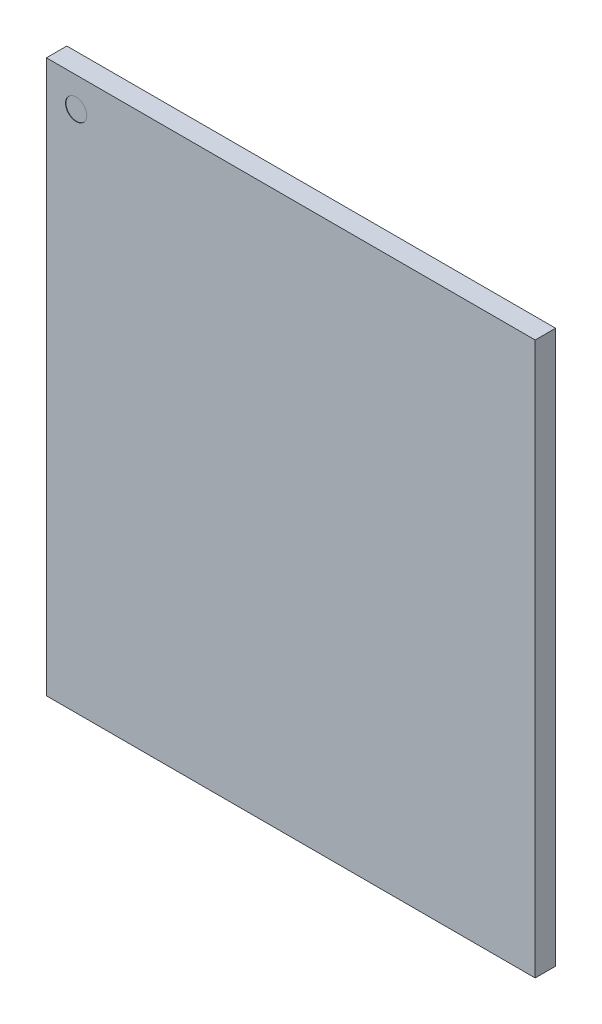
ISO-10303-21;
HEADER;
FILE_DESCRIPTION(('STEP AP214'),'2;1');
FILE_NAME('part.step','',(''),(''),'','','');
FILE_SCHEMA(('AUTOMOTIVE_DESIGN { 1 0 10303 214 1 1 1 1 }'));
ENDSEC;
DATA;
#1=APPLICATION_CONTEXT('core data for automotive mechanical design processes');
#2=APPLICATION_PROTOCOL_DEFINITION('international standard','automotive_design',2000,#1);
#3=PRODUCT_CONTEXT('',#1,'mechanical');
#4=PRODUCT('Part','Part','',(#3));
#5=PRODUCT_RELATED_PRODUCT_CATEGORY('part','',(#4));
#6=PRODUCT_DEFINITION_FORMATION('','',#4);
#7=PRODUCT_DEFINITION_CONTEXT('part definition',#1,'design');
#8=PRODUCT_DEFINITION('design','',#6,#7);
#9=PRODUCT_DEFINITION_SHAPE('','',#8);
#10=(LENGTH_UNIT() NAMED_UNIT(*) SI_UNIT(.MILLI.,.METRE.));
#11=(NAMED_UNIT(*) PLANE_ANGLE_UNIT() SI_UNIT($,.RADIAN.));
#12=(NAMED_UNIT(*) SI_UNIT($,.STERADIAN.) SOLID_ANGLE_UNIT());
#13=UNCERTAINTY_MEASURE_WITH_UNIT(LENGTH_MEASURE(1.E-05),#10,'distance_accuracy_value','');
#14=(GEOMETRIC_REPRESENTATION_CONTEXT(3) GLOBAL_UNCERTAINTY_ASSIGNED_CONTEXT((#13)) GLOBAL_UNIT_ASSIGNED_CONTEXT((#10,
#11,#12)) REPRESENTATION_CONTEXT('',''));
#15=CARTESIAN_POINT('',(0.,0.,0.));
#16=DIRECTION('',(0.,0.,1.));
#17=DIRECTION('',(1.,0.,0.));
#18=AXIS2_PLACEMENT_3D('',#15,#16,#17);
#19=CARTESIAN_POINT('',(0.,-6.4999999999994,0.635));
#20=DIRECTION('',(0.,0.,1.));
#21=DIRECTION('',(1.,0.,0.));
#22=AXIS2_PLACEMENT_3D('',#19,#20,#21);
#23=PLANE('',#22);
#24=CARTESIAN_POINT('',(-5.05000000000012,5.79999999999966,0.635));
#25=DIRECTION('',(0.,0.,1.));
#26=DIRECTION('',(1.,0.,0.));
#27=AXIS2_PLACEMENT_3D('',#24,#25,#26);
#28=CIRCLE('',#27,0.249999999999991);
#29=CARTESIAN_POINT('',(-4.80000000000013,5.79999999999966,0.635));
#30=VERTEX_POINT('',#29);
#31=EDGE_CURVE('E19',#30,#30,#28,.T.);
#32=ORIENTED_EDGE('',*,*,#31,.T.);
#33=EDGE_LOOP('',(#32));
#34=FACE_BOUND('',#33,.T.);
#35=ADVANCED_FACE('F16',(#34),#23,.T.);
#36=CARTESIAN_POINT('',(-5.05000000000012,5.79999999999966,0.64499999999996));
#37=DIRECTION('',(0.,0.,1.));
#38=DIRECTION('',(1.,0.,0.));
#39=AXIS2_PLACEMENT_3D('',#36,#37,#38);
#40=CYLINDRICAL_SURFACE('',#39,0.249999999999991);
#41=ORIENTED_EDGE('',*,*,#31,.F.);
#42=EDGE_LOOP('',(#41));
#43=FACE_BOUND('',#42,.T.);
#44=CARTESIAN_POINT('',(-5.05000000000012,5.79999999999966,0.64499999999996));
#45=DIRECTION('',(0.,0.,1.));
#46=DIRECTION('',(1.,0.,0.));
#47=AXIS2_PLACEMENT_3D('',#44,#45,#46);
#48=CIRCLE('',#47,0.249999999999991);
#49=CARTESIAN_POINT('',(-4.80000000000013,5.79999999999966,0.64499999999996));
#50=VERTEX_POINT('',#49);
#51=EDGE_CURVE('E68',#50,#50,#48,.F.);
#52=ORIENTED_EDGE('',*,*,#51,.F.);
#53=EDGE_LOOP('',(#52));
#54=FACE_BOUND('',#53,.T.);
#55=ADVANCED_FACE('F88',(#43,#54),#40,.F.);
#56=CARTESIAN_POINT('',(-5.74999999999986,-6.4999999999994,0.64499999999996));
#57=DIRECTION('',(0.,0.,1.));
#58=DIRECTION('',(1.,0.,0.));
#59=AXIS2_PLACEMENT_3D('',#56,#57,#58);
#60=PLANE('',#59);
#61=ORIENTED_EDGE('',*,*,#51,.T.);
#62=EDGE_LOOP('',(#61));
#63=FACE_BOUND('',#62,.T.);
#64=DIRECTION('',(0.,1.,0.));
#65=VECTOR('',#64,1.);
#66=CARTESIAN_POINT('',(-5.74999999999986,-6.4999999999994,0.64499999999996));
#67=LINE('',#66,#65);
#68=CARTESIAN_POINT('',(-5.74999999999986,-6.4999999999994,0.64499999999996));
#69=VERTEX_POINT('',#68);
#70=CARTESIAN_POINT('',(-5.74999999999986,6.4999999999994,0.64499999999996));
#71=VERTEX_POINT('',#70);
#72=EDGE_CURVE('E59',#69,#71,#67,.T.);
#73=ORIENTED_EDGE('',*,*,#72,.F.);
#74=DIRECTION('',(1.,0.,0.));
#75=VECTOR('',#74,1.);
#76=CARTESIAN_POINT('',(0.,-6.4999999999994,0.64499999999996));
#77=LINE('',#76,#75);
#78=CARTESIAN_POINT('',(5.74999999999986,-6.4999999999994,0.64499999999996));
#79=VERTEX_POINT('',#78);
#80=EDGE_CURVE('E199',#69,#79,#77,.T.);
#81=ORIENTED_EDGE('',*,*,#80,.T.);
#82=DIRECTION('',(0.,1.,0.));
#83=VECTOR('',#82,1.);
#84=CARTESIAN_POINT('',(5.74999999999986,-6.4999999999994,0.64499999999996));
#85=LINE('',#84,#83);
#86=CARTESIAN_POINT('',(5.74999999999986,6.4999999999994,0.64499999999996));
#87=VERTEX_POINT('',#86);
#88=EDGE_CURVE('E71',#87,#79,#85,.F.);
#89=ORIENTED_EDGE('',*,*,#88,.F.);
#90=DIRECTION('',(1.,0.,0.));
#91=VECTOR('',#90,1.);
#92=CARTESIAN_POINT('',(0.,6.4999999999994,0.64499999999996));
#93=LINE('',#92,#91);
#94=EDGE_CURVE('E54',#71,#87,#93,.T.);
#95=ORIENTED_EDGE('',*,*,#94,.F.);
#96=EDGE_LOOP('',(#73,#81,#89,#95));
#97=FACE_BOUND('',#96,.T.);
#98=ADVANCED_FACE('F70',(#63,#97),#60,.T.);
#99=CARTESIAN_POINT('',(-5.74999999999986,-6.4999999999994,0.165));
#100=DIRECTION('',(-1.,0.,0.));
#101=DIRECTION('',(0.,0.,1.));
#102=AXIS2_PLACEMENT_3D('',#99,#100,#101);
#103=PLANE('',#102);
#104=DIRECTION('',(0.,1.,0.));
#105=VECTOR('',#104,1.);
#106=CARTESIAN_POINT('',(-5.74999999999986,-6.4999999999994,0.165));
#107=LINE('',#106,#105);
#108=CARTESIAN_POINT('',(-5.74999999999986,-6.4999999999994,0.165));
#109=VERTEX_POINT('',#108);
#110=CARTESIAN_POINT('',(-5.74999999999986,6.4999999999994,0.165));
#111=VERTEX_POINT('',#110);
#112=EDGE_CURVE('E200',#109,#111,#107,.T.);
#113=ORIENTED_EDGE('',*,*,#112,.F.);
#114=DIRECTION('',(0.,0.,1.));
#115=VECTOR('',#114,1.);
#116=CARTESIAN_POINT('',(-5.74999999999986,-6.4999999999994,0.));
#117=LINE('',#116,#115);
#118=EDGE_CURVE('E64',#109,#69,#117,.T.);
#119=ORIENTED_EDGE('',*,*,#118,.T.);
#120=ORIENTED_EDGE('',*,*,#72,.T.);
#121=DIRECTION('',(0.,0.,1.));
#122=VECTOR('',#121,1.);
#123=CARTESIAN_POINT('',(-5.74999999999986,6.4999999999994,0.));
#124=LINE('',#123,#122);
#125=EDGE_CURVE('E61',#111,#71,#124,.T.);
#126=ORIENTED_EDGE('',*,*,#125,.F.);
#127=EDGE_LOOP('',(#113,#119,#120,#126));
#128=FACE_BOUND('',#127,.T.);
#129=ADVANCED_FACE('F60',(#128),#103,.T.);
#130=CARTESIAN_POINT('',(0.,6.4999999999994,0.));
#131=DIRECTION('',(0.,1.,0.));
#132=DIRECTION('',(0.,0.,1.));
#133=AXIS2_PLACEMENT_3D('',#130,#131,#132);
#134=PLANE('',#133);
#135=ORIENTED_EDGE('',*,*,#94,.T.);
#136=DIRECTION('',(0.,0.,-1.));
#137=VECTOR('',#136,1.);
#138=CARTESIAN_POINT('',(5.74999999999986,6.4999999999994,0.64499999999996));
#139=LINE('',#138,#137);
#140=CARTESIAN_POINT('',(5.74999999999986,6.4999999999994,0.165));
#141=VERTEX_POINT('',#140);
#142=EDGE_CURVE('E73',#141,#87,#139,.F.);
#143=ORIENTED_EDGE('',*,*,#142,.F.);
#144=DIRECTION('',(-1.,0.,0.));
#145=VECTOR('',#144,1.);
#146=CARTESIAN_POINT('',(5.74999999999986,6.4999999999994,0.165));
#147=LINE('',#146,#145);
#148=EDGE_CURVE('E77',#111,#141,#147,.F.);
#149=ORIENTED_EDGE('',*,*,#148,.F.);
#150=ORIENTED_EDGE('',*,*,#125,.T.);
#151=EDGE_LOOP('',(#135,#143,#149,#150));
#152=FACE_BOUND('',#151,.T.);
#153=ADVANCED_FACE('F75',(#152),#134,.T.);
#154=CARTESIAN_POINT('',(5.74999999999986,-6.4999999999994,0.64499999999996));
#155=DIRECTION('',(1.,0.,0.));
#156=DIRECTION('',(0.,0.,-1.));
#157=AXIS2_PLACEMENT_3D('',#154,#155,#156);
#158=PLANE('',#157);
#159=ORIENTED_EDGE('',*,*,#88,.T.);
#160=DIRECTION('',(0.,0.,1.));
#161=VECTOR('',#160,1.);
#162=CARTESIAN_POINT('',(5.74999999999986,-6.4999999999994,0.));
#163=LINE('',#162,#161);
#164=CARTESIAN_POINT('',(5.74999999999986,-6.4999999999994,0.165));
#165=VERTEX_POINT('',#164);
#166=EDGE_CURVE('E34',#79,#165,#163,.F.);
#167=ORIENTED_EDGE('',*,*,#166,.T.);
#168=DIRECTION('',(0.,1.,0.));
#169=VECTOR('',#168,1.);
#170=CARTESIAN_POINT('',(5.74999999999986,-6.4999999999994,0.165));
#171=LINE('',#170,#169);
#172=EDGE_CURVE('E25',#141,#165,#171,.F.);
#173=ORIENTED_EDGE('',*,*,#172,.F.);
#174=ORIENTED_EDGE('',*,*,#142,.T.);
#175=EDGE_LOOP('',(#159,#167,#173,#174));
#176=FACE_BOUND('',#175,.T.);
#177=ADVANCED_FACE('F105',(#176),#158,.T.);
#178=CARTESIAN_POINT('',(0.,-6.4999999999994,0.));
#179=DIRECTION('',(0.,1.,0.));
#180=DIRECTION('',(0.,0.,1.));
#181=AXIS2_PLACEMENT_3D('',#178,#179,#180);
#182=PLANE('',#181);
#183=ORIENTED_EDGE('',*,*,#118,.F.);
#184=DIRECTION('',(-1.,0.,0.));
#185=VECTOR('',#184,1.);
#186=CARTESIAN_POINT('',(5.74999999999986,-6.4999999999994,0.165));
#187=LINE('',#186,#185);
#188=EDGE_CURVE('E11',#165,#109,#187,.T.);
#189=ORIENTED_EDGE('',*,*,#188,.F.);
#190=ORIENTED_EDGE('',*,*,#166,.F.);
#191=ORIENTED_EDGE('',*,*,#80,.F.);
#192=EDGE_LOOP('',(#183,#189,#190,#191));
#193=FACE_BOUND('',#192,.T.);
#194=ADVANCED_FACE('F99',(#193),#182,.F.);
#195=CARTESIAN_POINT('',(5.74999999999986,-6.4999999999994,0.165));
#196=DIRECTION('',(0.,0.,-1.));
#197=DIRECTION('',(-1.,0.,0.));
#198=AXIS2_PLACEMENT_3D('',#195,#196,#197);
#199=PLANE('',#198);
#200=ORIENTED_EDGE('',*,*,#172,.T.);
#201=ORIENTED_EDGE('',*,*,#188,.T.);
#202=ORIENTED_EDGE('',*,*,#112,.T.);
#203=ORIENTED_EDGE('',*,*,#148,.T.);
#204=EDGE_LOOP('',(#200,#201,#202,#203));
#205=FACE_BOUND('',#204,.T.);
#206=ADVANCED_FACE('F97',(#205),#199,.T.);
#207=CLOSED_SHELL('',(#35,#55,#98,#129,#153,#177,#194,#206));
#208=MANIFOLD_SOLID_BREP('B1',#207);
#209=ADVANCED_BREP_SHAPE_REPRESENTATION('',(#18,#208),#14);
#210=SHAPE_DEFINITION_REPRESENTATION(#9,#209);
ENDSEC;
END-ISO-10303-21;
